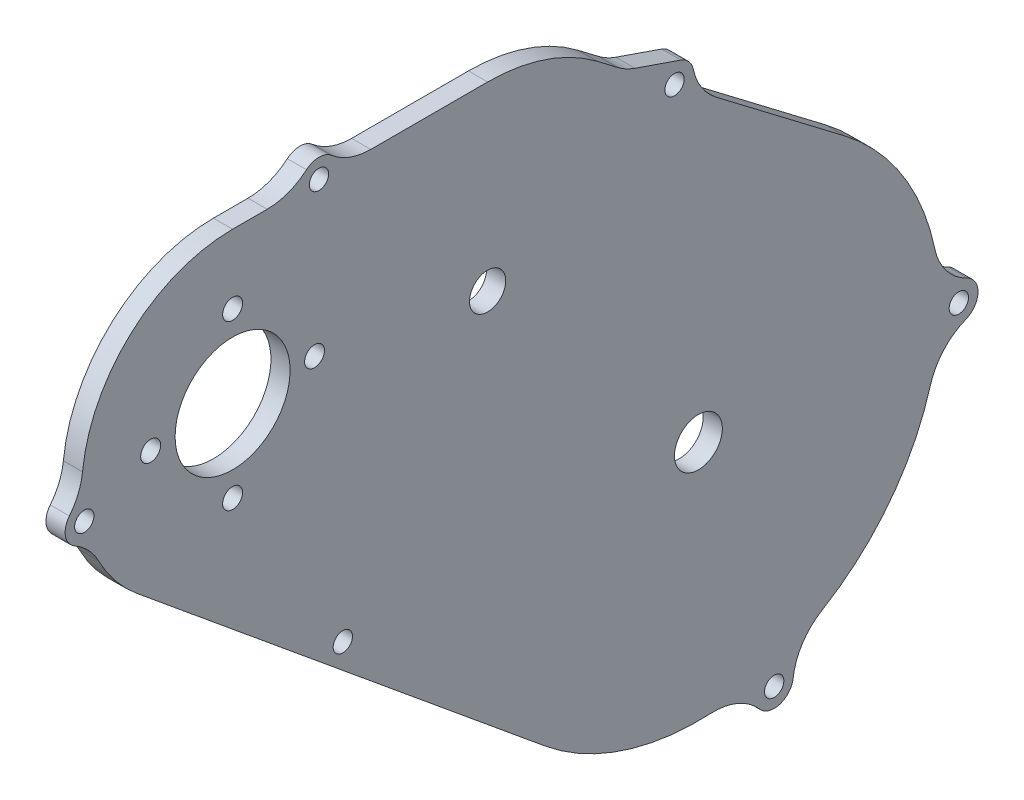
ISO-10303-21;
HEADER;
FILE_DESCRIPTION(('STEP AP214'),'2;1');
FILE_NAME('part.step','',(''),(''),'','','');
FILE_SCHEMA(('AUTOMOTIVE_DESIGN { 1 0 10303 214 1 1 1 1 }'));
ENDSEC;
DATA;
#1=APPLICATION_CONTEXT('core data for automotive mechanical design processes');
#2=APPLICATION_PROTOCOL_DEFINITION('international standard','automotive_design',2000,#1);
#3=PRODUCT_CONTEXT('',#1,'mechanical');
#4=PRODUCT('Part','Part','',(#3));
#5=PRODUCT_RELATED_PRODUCT_CATEGORY('part','',(#4));
#6=PRODUCT_DEFINITION_FORMATION('','',#4);
#7=PRODUCT_DEFINITION_CONTEXT('part definition',#1,'design');
#8=PRODUCT_DEFINITION('design','',#6,#7);
#9=PRODUCT_DEFINITION_SHAPE('','',#8);
#10=(LENGTH_UNIT() NAMED_UNIT(*) SI_UNIT(.MILLI.,.METRE.));
#11=(NAMED_UNIT(*) PLANE_ANGLE_UNIT() SI_UNIT($,.RADIAN.));
#12=(NAMED_UNIT(*) SI_UNIT($,.STERADIAN.) SOLID_ANGLE_UNIT());
#13=UNCERTAINTY_MEASURE_WITH_UNIT(LENGTH_MEASURE(1.E-05),#10,'distance_accuracy_value','');
#14=(GEOMETRIC_REPRESENTATION_CONTEXT(3) GLOBAL_UNCERTAINTY_ASSIGNED_CONTEXT((#13)) GLOBAL_UNIT_ASSIGNED_CONTEXT((#10,
#11,#12)) REPRESENTATION_CONTEXT('',''));
#15=CARTESIAN_POINT('',(0.,0.,0.));
#16=DIRECTION('',(0.,0.,1.));
#17=DIRECTION('',(1.,0.,0.));
#18=AXIS2_PLACEMENT_3D('',#15,#16,#17);
#19=CARTESIAN_POINT('',(6.35,244.8,-60.2996562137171));
#20=DIRECTION('',(-1.,0.,0.));
#21=DIRECTION('',(0.,0.,1.));
#22=AXIS2_PLACEMENT_3D('',#19,#20,#21);
#23=CYLINDRICAL_SURFACE('',#22,50.);
#24=CARTESIAN_POINT('',(0.,244.8,-60.2996562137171));
#25=DIRECTION('',(1.,0.,0.));
#26=DIRECTION('',(0.,0.,-1.));
#27=AXIS2_PLACEMENT_3D('',#24,#25,#26);
#28=CIRCLE('',#27,50.);
#29=CARTESIAN_POINT('',(0.,294.8,-60.2996562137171));
#30=VERTEX_POINT('',#29);
#31=CARTESIAN_POINT('',(0.,250.046117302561,-10.5756353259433));
#32=VERTEX_POINT('',#31);
#33=EDGE_CURVE('E273',#30,#32,#28,.T.);
#34=ORIENTED_EDGE('',*,*,#33,.T.);
#35=DIRECTION('',(-1.,0.,0.));
#36=VECTOR('',#35,1.);
#37=CARTESIAN_POINT('',(6.35,250.046117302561,-10.5756353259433));
#38=LINE('',#37,#36);
#39=CARTESIAN_POINT('',(6.35,250.046117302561,-10.5756353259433));
#40=VERTEX_POINT('',#39);
#41=EDGE_CURVE('E354',#32,#40,#38,.F.);
#42=ORIENTED_EDGE('',*,*,#41,.T.);
#43=CARTESIAN_POINT('',(6.35,244.8,-60.2996562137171));
#44=DIRECTION('',(1.,0.,0.));
#45=DIRECTION('',(0.,0.,-1.));
#46=AXIS2_PLACEMENT_3D('',#43,#44,#45);
#47=CIRCLE('',#46,50.);
#48=CARTESIAN_POINT('',(6.35,294.8,-60.2996562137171));
#49=VERTEX_POINT('',#48);
#50=EDGE_CURVE('E296',#49,#40,#47,.T.);
#51=ORIENTED_EDGE('',*,*,#50,.F.);
#52=DIRECTION('',(-1.,0.,0.));
#53=VECTOR('',#52,1.);
#54=CARTESIAN_POINT('',(6.35,294.8,-60.2996562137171));
#55=LINE('',#54,#53);
#56=EDGE_CURVE('E327',#49,#30,#55,.T.);
#57=ORIENTED_EDGE('',*,*,#56,.T.);
#58=EDGE_LOOP('',(#34,#42,#51,#57));
#59=FACE_BOUND('',#58,.T.);
#60=ADVANCED_FACE('F34',(#59),#23,.T.);
#61=CARTESIAN_POINT('',(6.35,294.8,1.93664151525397E-13));
#62=DIRECTION('',(0.,1.,0.));
#63=DIRECTION('',(0.,0.,1.));
#64=AXIS2_PLACEMENT_3D('',#61,#62,#63);
#65=PLANE('',#64);
#66=DIRECTION('',(0.,0.,-1.));
#67=VECTOR('',#66,1.);
#68=CARTESIAN_POINT('',(0.,294.8,1.93664151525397E-13));
#69=LINE('',#68,#67);
#70=CARTESIAN_POINT('',(0.,294.8,-106.074630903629));
#71=VERTEX_POINT('',#70);
#72=CARTESIAN_POINT('',(0.,294.8,-144.8));
#73=VERTEX_POINT('',#72);
#74=EDGE_CURVE('E318',#71,#73,#69,.T.);
#75=ORIENTED_EDGE('',*,*,#74,.F.);
#76=DIRECTION('',(1.,0.,0.));
#77=VECTOR('',#76,1.);
#78=CARTESIAN_POINT('',(6.35,294.8,-106.074630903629));
#79=LINE('',#78,#77);
#80=CARTESIAN_POINT('',(6.35,294.8,-106.074630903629));
#81=VERTEX_POINT('',#80);
#82=EDGE_CURVE('E344',#71,#81,#79,.T.);
#83=ORIENTED_EDGE('',*,*,#82,.T.);
#84=DIRECTION('',(0.,0.,-1.));
#85=VECTOR('',#84,1.);
#86=CARTESIAN_POINT('',(6.35,294.8,1.93664151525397E-13));
#87=LINE('',#86,#85);
#88=CARTESIAN_POINT('',(6.35,294.8,-144.8));
#89=VERTEX_POINT('',#88);
#90=EDGE_CURVE('E291',#81,#89,#87,.T.);
#91=ORIENTED_EDGE('',*,*,#90,.T.);
#92=DIRECTION('',(-1.,0.,0.));
#93=VECTOR('',#92,1.);
#94=CARTESIAN_POINT('',(6.35,294.8,-144.8));
#95=LINE('',#94,#93);
#96=EDGE_CURVE('E329',#89,#73,#95,.T.);
#97=ORIENTED_EDGE('',*,*,#96,.T.);
#98=EDGE_LOOP('',(#75,#83,#91,#97));
#99=FACE_BOUND('',#98,.T.);
#100=ADVANCED_FACE('F445',(#99),#65,.T.);
#101=CARTESIAN_POINT('',(6.35,266.222905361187,-202.586681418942));
#102=DIRECTION('',(0.,0.795791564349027,-0.605570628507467));
#103=DIRECTION('',(0.,0.605570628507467,0.795791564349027));
#104=AXIS2_PLACEMENT_3D('',#101,#102,#103);
#105=PLANE('',#104);
#106=DIRECTION('',(0.,-0.605570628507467,-0.795791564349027));
#107=VECTOR('',#106,1.);
#108=CARTESIAN_POINT('',(0.,266.222905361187,-202.586681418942));
#109=LINE('',#108,#107);
#110=CARTESIAN_POINT('',(0.,252.686938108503,-220.374546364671));
#111=VERTEX_POINT('',#110);
#112=CARTESIAN_POINT('',(0.,220.187155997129,-263.083111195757));
#113=VERTEX_POINT('',#112);
#114=EDGE_CURVE('E311',#111,#113,#109,.T.);
#115=ORIENTED_EDGE('',*,*,#114,.F.);
#116=DIRECTION('',(1.,0.,0.));
#117=VECTOR('',#116,1.);
#118=CARTESIAN_POINT('',(6.35,252.686938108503,-220.374546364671));
#119=LINE('',#118,#117);
#120=CARTESIAN_POINT('',(6.35,252.686938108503,-220.374546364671));
#121=VERTEX_POINT('',#120);
#122=EDGE_CURVE('E381',#111,#121,#119,.T.);
#123=ORIENTED_EDGE('',*,*,#122,.T.);
#124=DIRECTION('',(0.,-0.605570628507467,-0.795791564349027));
#125=VECTOR('',#124,1.);
#126=CARTESIAN_POINT('',(6.35,266.222905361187,-202.586681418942));
#127=LINE('',#126,#125);
#128=CARTESIAN_POINT('',(6.35,220.187155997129,-263.083111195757));
#129=VERTEX_POINT('',#128);
#130=EDGE_CURVE('E283',#121,#129,#127,.T.);
#131=ORIENTED_EDGE('',*,*,#130,.T.);
#132=DIRECTION('',(-1.,0.,0.));
#133=VECTOR('',#132,1.);
#134=CARTESIAN_POINT('',(6.35,220.187155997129,-263.083111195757));
#135=LINE('',#134,#133);
#136=EDGE_CURVE('E334',#129,#113,#135,.T.);
#137=ORIENTED_EDGE('',*,*,#136,.T.);
#138=EDGE_LOOP('',(#115,#123,#131,#137));
#139=FACE_BOUND('',#138,.T.);
#140=ADVANCED_FACE('F430',(#139),#105,.T.);
#141=CARTESIAN_POINT('',(6.35,156.523830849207,-214.637460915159));
#142=DIRECTION('',(-1.,0.,0.));
#143=DIRECTION('',(0.,0.,1.));
#144=AXIS2_PLACEMENT_3D('',#141,#142,#143);
#145=CYLINDRICAL_SURFACE('',#144,80.);
#146=CARTESIAN_POINT('',(6.35,156.523830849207,-214.637460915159));
#147=DIRECTION('',(1.,0.,0.));
#148=DIRECTION('',(0.,0.,-1.));
#149=AXIS2_PLACEMENT_3D('',#146,#147,#148);
#150=CIRCLE('',#149,80.);
#151=CARTESIAN_POINT('',(6.35,87.8295366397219,-255.638606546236));
#152=VERTEX_POINT('',#151);
#153=CARTESIAN_POINT('',(6.35,134.421111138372,-291.523544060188));
#154=VERTEX_POINT('',#153);
#155=EDGE_CURVE('E284',#152,#154,#150,.T.);
#156=ORIENTED_EDGE('',*,*,#155,.F.);
#157=DIRECTION('',(-1.,0.,0.));
#158=VECTOR('',#157,1.);
#159=CARTESIAN_POINT('',(6.35,87.8295366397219,-255.638606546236));
#160=LINE('',#159,#158);
#161=CARTESIAN_POINT('',(0.,87.8295366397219,-255.638606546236));
#162=VERTEX_POINT('',#161);
#163=EDGE_CURVE('E368',#152,#162,#160,.T.);
#164=ORIENTED_EDGE('',*,*,#163,.T.);
#165=CARTESIAN_POINT('',(0.,156.523830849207,-214.637460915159));
#166=DIRECTION('',(1.,0.,0.));
#167=DIRECTION('',(0.,0.,-1.));
#168=AXIS2_PLACEMENT_3D('',#165,#166,#167);
#169=CIRCLE('',#168,80.);
#170=CARTESIAN_POINT('',(0.,134.421111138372,-291.523544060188));
#171=VERTEX_POINT('',#170);
#172=EDGE_CURVE('E312',#162,#171,#169,.T.);
#173=ORIENTED_EDGE('',*,*,#172,.T.);
#174=DIRECTION('',(-1.,0.,0.));
#175=VECTOR('',#174,1.);
#176=CARTESIAN_POINT('',(6.35,134.421111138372,-291.523544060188));
#177=LINE('',#176,#175);
#178=EDGE_CURVE('E366',#171,#154,#177,.F.);
#179=ORIENTED_EDGE('',*,*,#178,.T.);
#180=EDGE_LOOP('',(#156,#164,#173,#179));
#181=FACE_BOUND('',#180,.T.);
#182=ADVANCED_FACE('F618',(#181),#145,.T.);
#183=CARTESIAN_POINT('',(6.35,172.916566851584,-292.939939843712));
#184=VERTEX_POINT('',#183);
#185=EDGE_CURVE('E279',#184,#129,#150,.T.);
#186=ORIENTED_EDGE('',*,*,#185,.F.);
#187=DIRECTION('',(-1.,0.,0.));
#188=VECTOR('',#187,1.);
#189=CARTESIAN_POINT('',(6.35,172.916566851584,-292.939939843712));
#190=LINE('',#189,#188);
#191=CARTESIAN_POINT('',(0.,172.916566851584,-292.939939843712));
#192=VERTEX_POINT('',#191);
#193=EDGE_CURVE('E371',#184,#192,#190,.T.);
#194=ORIENTED_EDGE('',*,*,#193,.T.);
#195=EDGE_CURVE('E307',#192,#113,#169,.T.);
#196=ORIENTED_EDGE('',*,*,#195,.T.);
#197=ORIENTED_EDGE('',*,*,#136,.F.);
#198=EDGE_LOOP('',(#186,#194,#196,#197));
#199=FACE_BOUND('',#198,.T.);
#200=ADVANCED_FACE('F619',(#199),#145,.T.);
#201=CARTESIAN_POINT('',(6.35,136.831335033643,-112.723133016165));
#202=DIRECTION('',(0.,-0.771823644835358,0.635836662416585));
#203=DIRECTION('',(0.,-0.635836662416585,-0.771823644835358));
#204=AXIS2_PLACEMENT_3D('',#201,#202,#203);
#205=PLANE('',#204);
#206=DIRECTION('',(0.,0.635836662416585,0.771823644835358));
#207=VECTOR('',#206,1.);
#208=CARTESIAN_POINT('',(0.,136.831335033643,-112.723133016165));
#209=LINE('',#208,#207);
#210=CARTESIAN_POINT('',(0.,94.7779392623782,-163.770527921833));
#211=VERTEX_POINT('',#210);
#212=CARTESIAN_POINT('',(0.,206.208817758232,-28.5078230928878));
#213=VERTEX_POINT('',#212);
#214=EDGE_CURVE('E304',#211,#213,#209,.T.);
#215=ORIENTED_EDGE('',*,*,#214,.F.);
#216=DIRECTION('',(-1.,0.,0.));
#217=VECTOR('',#216,1.);
#218=CARTESIAN_POINT('',(6.35,94.7779392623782,-163.770527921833));
#219=LINE('',#218,#217);
#220=CARTESIAN_POINT('',(6.35,94.7779392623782,-163.770527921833));
#221=VERTEX_POINT('',#220);
#222=EDGE_CURVE('E337',#221,#211,#219,.T.);
#223=ORIENTED_EDGE('',*,*,#222,.F.);
#224=DIRECTION('',(0.,0.635836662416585,0.771823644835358));
#225=VECTOR('',#224,1.);
#226=CARTESIAN_POINT('',(6.35,136.831335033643,-112.723133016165));
#227=LINE('',#226,#225);
#228=CARTESIAN_POINT('',(6.35,206.208817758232,-28.5078230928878));
#229=VERTEX_POINT('',#228);
#230=EDGE_CURVE('E276',#221,#229,#227,.T.);
#231=ORIENTED_EDGE('',*,*,#230,.T.);
#232=DIRECTION('',(-1.,0.,0.));
#233=VECTOR('',#232,1.);
#234=CARTESIAN_POINT('',(6.35,206.208817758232,-28.5078230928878));
#235=LINE('',#234,#233);
#236=EDGE_CURVE('E298',#229,#213,#235,.T.);
#237=ORIENTED_EDGE('',*,*,#236,.T.);
#238=EDGE_LOOP('',(#215,#223,#231,#237));
#239=FACE_BOUND('',#238,.T.);
#240=ADVANCED_FACE('F615',(#239),#205,.T.);
#241=CARTESIAN_POINT('',(0.,76.6311943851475,-218.780725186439));
#242=VERTEX_POINT('',#241);
#243=EDGE_CURVE('E308',#211,#242,#169,.T.);
#244=ORIENTED_EDGE('',*,*,#243,.T.);
#245=DIRECTION('',(-1.,0.,0.));
#246=VECTOR('',#245,1.);
#247=CARTESIAN_POINT('',(6.35,76.6311943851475,-218.780725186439));
#248=LINE('',#247,#246);
#249=CARTESIAN_POINT('',(6.35,76.6311943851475,-218.780725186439));
#250=VERTEX_POINT('',#249);
#251=EDGE_CURVE('E364',#242,#250,#248,.F.);
#252=ORIENTED_EDGE('',*,*,#251,.T.);
#253=EDGE_CURVE('E280',#221,#250,#150,.T.);
#254=ORIENTED_EDGE('',*,*,#253,.F.);
#255=ORIENTED_EDGE('',*,*,#222,.T.);
#256=EDGE_LOOP('',(#244,#252,#254,#255));
#257=FACE_BOUND('',#256,.T.);
#258=ADVANCED_FACE('F608',(#257),#145,.T.);
#259=CARTESIAN_POINT('',(6.35,282.547493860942,-181.134237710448));
#260=VERTEX_POINT('',#259);
#261=CARTESIAN_POINT('',(6.35,277.316939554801,-188.007805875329));
#262=VERTEX_POINT('',#261);
#263=EDGE_CURVE('E285',#260,#262,#127,.T.);
#264=ORIENTED_EDGE('',*,*,#263,.T.);
#265=DIRECTION('',(-1.,0.,0.));
#266=VECTOR('',#265,1.);
#267=CARTESIAN_POINT('',(0.,277.316939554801,-188.007805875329));
#268=LINE('',#267,#266);
#269=CARTESIAN_POINT('',(0.,277.316939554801,-188.007805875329));
#270=VERTEX_POINT('',#269);
#271=EDGE_CURVE('E383',#262,#270,#268,.T.);
#272=ORIENTED_EDGE('',*,*,#271,.T.);
#273=CARTESIAN_POINT('',(0.,282.547493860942,-181.134237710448));
#274=VERTEX_POINT('',#273);
#275=EDGE_CURVE('E313',#274,#270,#109,.T.);
#276=ORIENTED_EDGE('',*,*,#275,.F.);
#277=DIRECTION('',(-1.,0.,0.));
#278=VECTOR('',#277,1.);
#279=CARTESIAN_POINT('',(6.35,282.547493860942,-181.134237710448));
#280=LINE('',#279,#278);
#281=EDGE_CURVE('E332',#260,#274,#280,.T.);
#282=ORIENTED_EDGE('',*,*,#281,.F.);
#283=EDGE_LOOP('',(#264,#272,#276,#282));
#284=FACE_BOUND('',#283,.T.);
#285=ADVANCED_FACE('F604',(#284),#105,.T.);
#286=CARTESIAN_POINT('',(6.35,234.8,-144.8));
#287=DIRECTION('',(-1.,0.,0.));
#288=DIRECTION('',(0.,0.,1.));
#289=AXIS2_PLACEMENT_3D('',#286,#287,#288);
#290=CYLINDRICAL_SURFACE('',#289,60.);
#291=CARTESIAN_POINT('',(0.,234.8,-144.8));
#292=DIRECTION('',(1.,0.,0.));
#293=DIRECTION('',(0.,0.,-1.));
#294=AXIS2_PLACEMENT_3D('',#291,#292,#293);
#295=CIRCLE('',#294,60.);
#296=EDGE_CURVE('E315',#274,#73,#295,.T.);
#297=ORIENTED_EDGE('',*,*,#296,.T.);
#298=ORIENTED_EDGE('',*,*,#96,.F.);
#299=CARTESIAN_POINT('',(6.35,234.8,-144.8));
#300=DIRECTION('',(1.,0.,0.));
#301=DIRECTION('',(0.,0.,-1.));
#302=AXIS2_PLACEMENT_3D('',#299,#300,#301);
#303=CIRCLE('',#302,60.);
#304=EDGE_CURVE('E288',#260,#89,#303,.T.);
#305=ORIENTED_EDGE('',*,*,#304,.F.);
#306=ORIENTED_EDGE('',*,*,#281,.T.);
#307=EDGE_LOOP('',(#297,#298,#305,#306));
#308=FACE_BOUND('',#307,.T.);
#309=ADVANCED_FACE('F601',(#308),#290,.T.);
#310=CARTESIAN_POINT('',(6.35,294.8,-71.76297107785));
#311=VERTEX_POINT('',#310);
#312=EDGE_CURVE('E292',#49,#311,#87,.T.);
#313=ORIENTED_EDGE('',*,*,#312,.T.);
#314=DIRECTION('',(1.,0.,0.));
#315=VECTOR('',#314,1.);
#316=CARTESIAN_POINT('',(0.,294.8,-71.76297107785));
#317=LINE('',#316,#315);
#318=CARTESIAN_POINT('',(0.,294.8,-71.76297107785));
#319=VERTEX_POINT('',#318);
#320=EDGE_CURVE('E346',#311,#319,#317,.F.);
#321=ORIENTED_EDGE('',*,*,#320,.T.);
#322=EDGE_CURVE('E319',#30,#319,#69,.T.);
#323=ORIENTED_EDGE('',*,*,#322,.F.);
#324=ORIENTED_EDGE('',*,*,#56,.F.);
#325=EDGE_LOOP('',(#313,#321,#323,#324));
#326=FACE_BOUND('',#325,.T.);
#327=ADVANCED_FACE('F454',(#326),#65,.T.);
#328=CARTESIAN_POINT('',(6.35,156.523830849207,-214.637460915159));
#329=DIRECTION('',(-1.,0.,0.));
#330=DIRECTION('',(0.,0.,1.));
#331=AXIS2_PLACEMENT_3D('',#328,#329,#330);
#332=CYLINDRICAL_SURFACE('',#331,7.93749999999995);
#333=CARTESIAN_POINT('',(6.35,156.523830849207,-214.637460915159));
#334=DIRECTION('',(1.,0.,0.));
#335=DIRECTION('',(0.,0.,-1.));
#336=AXIS2_PLACEMENT_3D('',#333,#334,#335);
#337=CIRCLE('',#336,7.93749999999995);
#338=CARTESIAN_POINT('',(6.35,156.523830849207,-222.574960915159));
#339=VERTEX_POINT('',#338);
#340=EDGE_CURVE('E272',#339,#339,#337,.T.);
#341=ORIENTED_EDGE('',*,*,#340,.T.);
#342=EDGE_LOOP('',(#341));
#343=FACE_BOUND('',#342,.T.);
#344=CARTESIAN_POINT('',(0.,156.523830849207,-214.637460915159));
#345=DIRECTION('',(1.,0.,0.));
#346=DIRECTION('',(0.,0.,-1.));
#347=AXIS2_PLACEMENT_3D('',#344,#345,#346);
#348=CIRCLE('',#347,7.93749999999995);
#349=CARTESIAN_POINT('',(0.,156.523830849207,-222.574960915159));
#350=VERTEX_POINT('',#349);
#351=EDGE_CURVE('E301',#350,#350,#348,.T.);
#352=ORIENTED_EDGE('',*,*,#351,.F.);
#353=EDGE_LOOP('',(#352));
#354=FACE_BOUND('',#353,.T.);
#355=ADVANCED_FACE('F466',(#343,#354),#332,.F.);
#356=CARTESIAN_POINT('',(6.35,234.8,-144.8));
#357=DIRECTION('',(-1.,0.,0.));
#358=DIRECTION('',(0.,0.,1.));
#359=AXIS2_PLACEMENT_3D('',#356,#357,#358);
#360=CYLINDRICAL_SURFACE('',#359,6.00000000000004);
#361=CARTESIAN_POINT('',(6.35,234.8,-144.8));
#362=DIRECTION('',(1.,0.,0.));
#363=DIRECTION('',(0.,0.,-1.));
#364=AXIS2_PLACEMENT_3D('',#361,#362,#363);
#365=CIRCLE('',#364,6.00000000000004);
#366=CARTESIAN_POINT('',(6.35,234.8,-150.8));
#367=VERTEX_POINT('',#366);
#368=EDGE_CURVE('E269',#367,#367,#365,.T.);
#369=ORIENTED_EDGE('',*,*,#368,.T.);
#370=EDGE_LOOP('',(#369));
#371=FACE_BOUND('',#370,.T.);
#372=CARTESIAN_POINT('',(0.,234.8,-144.8));
#373=DIRECTION('',(1.,0.,0.));
#374=DIRECTION('',(0.,0.,-1.));
#375=AXIS2_PLACEMENT_3D('',#372,#373,#374);
#376=CIRCLE('',#375,6.00000000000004);
#377=CARTESIAN_POINT('',(0.,234.8,-150.8));
#378=VERTEX_POINT('',#377);
#379=EDGE_CURVE('E264',#378,#378,#376,.T.);
#380=ORIENTED_EDGE('',*,*,#379,.F.);
#381=EDGE_LOOP('',(#380));
#382=FACE_BOUND('',#381,.T.);
#383=ADVANCED_FACE('F457',(#371,#382),#360,.F.);
#384=CARTESIAN_POINT('',(6.35,221.848250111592,-15.8787469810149));
#385=VERTEX_POINT('',#384);
#386=EDGE_CURVE('E295',#385,#229,#47,.T.);
#387=ORIENTED_EDGE('',*,*,#386,.F.);
#388=DIRECTION('',(-1.,0.,0.));
#389=VECTOR('',#388,1.);
#390=CARTESIAN_POINT('',(6.35,221.848250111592,-15.8787469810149));
#391=LINE('',#390,#389);
#392=CARTESIAN_POINT('',(0.,221.848250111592,-15.8787469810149));
#393=VERTEX_POINT('',#392);
#394=EDGE_CURVE('E356',#385,#393,#391,.T.);
#395=ORIENTED_EDGE('',*,*,#394,.T.);
#396=EDGE_CURVE('E322',#393,#213,#28,.T.);
#397=ORIENTED_EDGE('',*,*,#396,.T.);
#398=ORIENTED_EDGE('',*,*,#236,.F.);
#399=EDGE_LOOP('',(#387,#395,#397,#398));
#400=FACE_BOUND('',#399,.T.);
#401=ADVANCED_FACE('F448',(#400),#23,.T.);
#402=CARTESIAN_POINT('',(6.35,0.,0.));
#403=DIRECTION('',(1.,0.,0.));
#404=DIRECTION('',(0.,0.,-1.));
#405=AXIS2_PLACEMENT_3D('',#402,#403,#404);
#406=PLANE('',#405);
#407=CARTESIAN_POINT('',(6.35,271.95,-60.2996562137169));
#408=DIRECTION('',(-1.,0.,0.));
#409=DIRECTION('',(0.,0.,1.));
#410=AXIS2_PLACEMENT_3D('',#407,#408,#409);
#411=CIRCLE('',#410,3.30199999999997);
#412=CARTESIAN_POINT('',(6.35,271.95,-56.997656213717));
#413=VERTEX_POINT('',#412);
#414=EDGE_CURVE('E995',#413,#413,#411,.T.);
#415=ORIENTED_EDGE('',*,*,#414,.T.);
#416=EDGE_LOOP('',(#415));
#417=FACE_BOUND('',#416,.T.);
#418=CARTESIAN_POINT('',(6.35,244.8,-87.4496562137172));
#419=DIRECTION('',(-1.,0.,0.));
#420=DIRECTION('',(0.,0.,1.));
#421=AXIS2_PLACEMENT_3D('',#418,#419,#420);
#422=CIRCLE('',#421,3.30200000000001);
#423=CARTESIAN_POINT('',(6.35,244.8,-84.1476562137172));
#424=VERTEX_POINT('',#423);
#425=EDGE_CURVE('E999',#424,#424,#422,.T.);
#426=ORIENTED_EDGE('',*,*,#425,.T.);
#427=EDGE_LOOP('',(#426));
#428=FACE_BOUND('',#427,.T.);
#429=CARTESIAN_POINT('',(6.35,217.65,-60.2996562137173));
#430=DIRECTION('',(-1.,0.,0.));
#431=DIRECTION('',(0.,0.,1.));
#432=AXIS2_PLACEMENT_3D('',#429,#430,#431);
#433=CIRCLE('',#432,3.30200000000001);
#434=CARTESIAN_POINT('',(6.35,217.65,-56.9976562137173));
#435=VERTEX_POINT('',#434);
#436=EDGE_CURVE('E1003',#435,#435,#433,.T.);
#437=ORIENTED_EDGE('',*,*,#436,.T.);
#438=EDGE_LOOP('',(#437));
#439=FACE_BOUND('',#438,.T.);
#440=CARTESIAN_POINT('',(6.35,244.8,-33.1496562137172));
#441=DIRECTION('',(-1.,0.,0.));
#442=DIRECTION('',(0.,0.,1.));
#443=AXIS2_PLACEMENT_3D('',#440,#441,#442);
#444=CIRCLE('',#443,3.30199999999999);
#445=CARTESIAN_POINT('',(6.35,244.8,-29.8476562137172));
#446=VERTEX_POINT('',#445);
#447=EDGE_CURVE('E1007',#446,#446,#444,.T.);
#448=ORIENTED_EDGE('',*,*,#447,.T.);
#449=EDGE_LOOP('',(#448));
#450=FACE_BOUND('',#449,.T.);
#451=CARTESIAN_POINT('',(6.35,244.8,-60.2996562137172));
#452=DIRECTION('',(-1.,0.,0.));
#453=DIRECTION('',(0.,0.,1.));
#454=AXIS2_PLACEMENT_3D('',#451,#452,#453);
#455=CIRCLE('',#454,19.05);
#456=CARTESIAN_POINT('',(6.35,244.8,-41.2496562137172));
#457=VERTEX_POINT('',#456);
#458=EDGE_CURVE('E565',#457,#457,#455,.T.);
#459=ORIENTED_EDGE('',*,*,#458,.T.);
#460=EDGE_LOOP('',(#459));
#461=FACE_BOUND('',#460,.T.);
#462=CARTESIAN_POINT('',(6.35,263.076004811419,-206.722081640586));
#463=DIRECTION('',(-1.,0.,0.));
#464=DIRECTION('',(0.,0.,1.));
#465=AXIS2_PLACEMENT_3D('',#462,#463,#464);
#466=CIRCLE('',#465,3.2);
#467=CARTESIAN_POINT('',(6.35,263.076004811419,-203.522081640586));
#468=VERTEX_POINT('',#467);
#469=EDGE_CURVE('E218',#468,#468,#466,.T.);
#470=ORIENTED_EDGE('',*,*,#469,.T.);
#471=EDGE_LOOP('',(#470));
#472=FACE_BOUND('',#471,.T.);
#473=CARTESIAN_POINT('',(6.35,294.8,-88.9188009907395));
#474=DIRECTION('',(-1.,0.,0.));
#475=DIRECTION('',(0.,0.,1.));
#476=AXIS2_PLACEMENT_3D('',#473,#474,#475);
#477=CIRCLE('',#476,3.2);
#478=CARTESIAN_POINT('',(6.35,294.8,-85.7188009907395));
#479=VERTEX_POINT('',#478);
#480=EDGE_CURVE('E496',#479,#479,#477,.T.);
#481=ORIENTED_EDGE('',*,*,#480,.T.);
#482=EDGE_LOOP('',(#481));
#483=FACE_BOUND('',#482,.T.);
#484=CARTESIAN_POINT('',(6.35,235.558619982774,-11.1611082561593));
#485=DIRECTION('',(-1.,0.,0.));
#486=DIRECTION('',(0.,0.,1.));
#487=AXIS2_PLACEMENT_3D('',#484,#485,#486);
#488=CIRCLE('',#487,3.20000000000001);
#489=CARTESIAN_POINT('',(6.35,235.558619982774,-7.9611082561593));
#490=VERTEX_POINT('',#489);
#491=EDGE_CURVE('E485',#490,#490,#488,.T.);
#492=ORIENTED_EDGE('',*,*,#491,.T.);
#493=EDGE_LOOP('',(#492));
#494=FACE_BOUND('',#493,.T.);
#495=CARTESIAN_POINT('',(6.35,158.155733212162,-96.8249073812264));
#496=DIRECTION('',(-1.,0.,0.));
#497=DIRECTION('',(0.,0.,1.));
#498=AXIS2_PLACEMENT_3D('',#495,#496,#497);
#499=CIRCLE('',#498,3.20000000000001);
#500=CARTESIAN_POINT('',(6.35,158.155733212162,-93.6249073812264));
#501=VERTEX_POINT('',#500);
#502=EDGE_CURVE('E492',#501,#501,#499,.T.);
#503=ORIENTED_EDGE('',*,*,#502,.T.);
#504=EDGE_LOOP('',(#503));
#505=FACE_BOUND('',#504,.T.);
#506=ORIENTED_EDGE('',*,*,#50,.T.);
#507=CARTESIAN_POINT('',(6.35,252.144564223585,9.31397302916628));
#508=DIRECTION('',(1.,0.,0.));
#509=DIRECTION('',(0.,0.,-1.));
#510=AXIS2_PLACEMENT_3D('',#507,#508,#509);
#511=CIRCLE('',#510,20.);
#512=CARTESIAN_POINT('',(6.35,239.555612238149,-6.22688563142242));
#513=VERTEX_POINT('',#512);
#514=EDGE_CURVE('E397',#40,#513,#511,.F.);
#515=ORIENTED_EDGE('',*,*,#514,.T.);
#516=CARTESIAN_POINT('',(6.35,235.558619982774,-11.1611082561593));
#517=DIRECTION('',(-1.,0.,0.));
#518=DIRECTION('',(0.,0.,1.));
#519=AXIS2_PLACEMENT_3D('',#516,#517,#518);
#520=CIRCLE('',#519,6.34999999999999);
#521=CARTESIAN_POINT('',(6.35,230.042176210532,-8.01605688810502));
#522=VERTEX_POINT('',#521);
#523=EDGE_CURVE('E489',#522,#513,#520,.T.);
#524=ORIENTED_EDGE('',*,*,#523,.F.);
#525=CARTESIAN_POINT('',(6.35,212.667550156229,1.88961671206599));
#526=DIRECTION('',(1.,0.,0.));
#527=DIRECTION('',(0.,0.,-1.));
#528=AXIS2_PLACEMENT_3D('',#525,#526,#527);
#529=CIRCLE('',#528,20.);
#530=EDGE_CURVE('E401',#522,#385,#529,.F.);
#531=ORIENTED_EDGE('',*,*,#530,.T.);
#532=ORIENTED_EDGE('',*,*,#386,.T.);
#533=ORIENTED_EDGE('',*,*,#230,.F.);
#534=ORIENTED_EDGE('',*,*,#253,.T.);
#535=CARTESIAN_POINT('',(6.35,56.6580352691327,-219.816541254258));
#536=DIRECTION('',(1.,0.,0.));
#537=DIRECTION('',(0.,0.,-1.));
#538=AXIS2_PLACEMENT_3D('',#535,#536,#537);
#539=CIRCLE('',#538,20.);
#540=CARTESIAN_POINT('',(6.35,69.7472049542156,-234.938500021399));
#541=VERTEX_POINT('',#540);
#542=EDGE_CURVE('E405',#250,#541,#539,.F.);
#543=ORIENTED_EDGE('',*,*,#542,.T.);
#544=CARTESIAN_POINT('',(6.35,73.9030163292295,-239.739721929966));
#545=DIRECTION('',(-1.,0.,0.));
#546=DIRECTION('',(0.,0.,1.));
#547=AXIS2_PLACEMENT_3D('',#544,#545,#546);
#548=CIRCLE('',#547,6.35);
#549=CARTESIAN_POINT('',(6.35,73.1205196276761,-246.041324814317));
#550=VERTEX_POINT('',#549);
#551=EDGE_CURVE('E248',#550,#541,#548,.T.);
#552=ORIENTED_EDGE('',*,*,#551,.F.);
#553=CARTESIAN_POINT('',(6.35,70.6559630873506,-265.888892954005));
#554=DIRECTION('',(1.,0.,0.));
#555=DIRECTION('',(0.,0.,-1.));
#556=AXIS2_PLACEMENT_3D('',#553,#554,#555);
#557=CIRCLE('',#556,20.);
#558=EDGE_CURVE('E409',#550,#152,#557,.F.);
#559=ORIENTED_EDGE('',*,*,#558,.T.);
#560=ORIENTED_EDGE('',*,*,#155,.T.);
#561=CARTESIAN_POINT('',(6.35,128.895431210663,-310.745064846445));
#562=DIRECTION('',(1.,0.,0.));
#563=DIRECTION('',(0.,0.,-1.));
#564=AXIS2_PLACEMENT_3D('',#561,#562,#563);
#565=CIRCLE('',#564,20.);
#566=CARTESIAN_POINT('',(6.35,147.455886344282,-303.294594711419));
#567=VERTEX_POINT('',#566);
#568=EDGE_CURVE('E417',#154,#567,#565,.F.);
#569=ORIENTED_EDGE('',*,*,#568,.T.);
#570=CARTESIAN_POINT('',(6.35,153.348830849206,-300.929070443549));
#571=DIRECTION('',(-1.,0.,0.));
#572=DIRECTION('',(0.,0.,1.));
#573=AXIS2_PLACEMENT_3D('',#570,#571,#572);
#574=CIRCLE('',#573,6.35000000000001);
#575=CARTESIAN_POINT('',(6.35,159.052003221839,-303.721260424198));
#576=VERTEX_POINT('',#575);
#577=EDGE_CURVE('E260',#576,#567,#574,.T.);
#578=ORIENTED_EDGE('',*,*,#577,.F.);
#579=CARTESIAN_POINT('',(6.35,177.014750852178,-312.51555957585));
#580=DIRECTION('',(1.,0.,0.));
#581=DIRECTION('',(0.,0.,-1.));
#582=AXIS2_PLACEMENT_3D('',#579,#580,#581);
#583=CIRCLE('',#582,20.);
#584=EDGE_CURVE('E413',#576,#184,#583,.F.);
#585=ORIENTED_EDGE('',*,*,#584,.T.);
#586=ORIENTED_EDGE('',*,*,#185,.T.);
#587=ORIENTED_EDGE('',*,*,#130,.F.);
#588=CARTESIAN_POINT('',(6.35,268.602769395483,-232.48595893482));
#589=DIRECTION('',(1.,0.,0.));
#590=DIRECTION('',(0.,0.,-1.));
#591=AXIS2_PLACEMENT_3D('',#588,#589,#590);
#592=CIRCLE('',#591,20.);
#593=CARTESIAN_POINT('',(6.35,264.407881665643,-212.930833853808));
#594=VERTEX_POINT('',#593);
#595=EDGE_CURVE('E234',#121,#594,#592,.F.);
#596=ORIENTED_EDGE('',*,*,#595,.T.);
#597=CARTESIAN_POINT('',(6.35,263.076004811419,-206.722081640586));
#598=DIRECTION('',(-1.,0.,0.));
#599=DIRECTION('',(0.,0.,1.));
#600=AXIS2_PLACEMENT_3D('',#597,#598,#599);
#601=CIRCLE('',#600,6.35000000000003);
#602=CARTESIAN_POINT('',(6.35,269.078231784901,-208.794705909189));
#603=VERTEX_POINT('',#602);
#604=EDGE_CURVE('E217',#603,#594,#601,.T.);
#605=ORIENTED_EDGE('',*,*,#604,.F.);
#606=DIRECTION('',(0.,-0.326397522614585,-0.945232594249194));
#607=VECTOR('',#606,1.);
#608=CARTESIAN_POINT('',(6.35,304.829562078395,-105.260455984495));
#609=LINE('',#608,#607);
#610=CARTESIAN_POINT('',(6.35,274.328118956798,-193.591267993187));
#611=VERTEX_POINT('',#610);
#612=EDGE_CURVE('E209',#611,#603,#609,.T.);
#613=ORIENTED_EDGE('',*,*,#612,.F.);
#614=CARTESIAN_POINT('',(6.35,293.232770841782,-200.119218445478));
#615=DIRECTION('',(1.,0.,0.));
#616=DIRECTION('',(0.,0.,-1.));
#617=AXIS2_PLACEMENT_3D('',#614,#615,#616);
#618=CIRCLE('',#617,20.);
#619=EDGE_CURVE('E11',#611,#262,#618,.F.);
#620=ORIENTED_EDGE('',*,*,#619,.T.);
#621=ORIENTED_EDGE('',*,*,#263,.F.);
#622=ORIENTED_EDGE('',*,*,#304,.T.);
#623=ORIENTED_EDGE('',*,*,#90,.F.);
#624=CARTESIAN_POINT('',(6.35,314.8,-106.074630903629));
#625=DIRECTION('',(1.,0.,0.));
#626=DIRECTION('',(0.,0.,-1.));
#627=AXIS2_PLACEMENT_3D('',#624,#625,#626);
#628=CIRCLE('',#627,20.);
#629=CARTESIAN_POINT('',(6.35,299.619734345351,-93.0531281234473));
#630=VERTEX_POINT('',#629);
#631=EDGE_CURVE('E389',#81,#630,#628,.F.);
#632=ORIENTED_EDGE('',*,*,#631,.T.);
#633=CARTESIAN_POINT('',(6.35,294.8,-88.9188009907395));
#634=DIRECTION('',(-1.,0.,0.));
#635=DIRECTION('',(0.,0.,1.));
#636=AXIS2_PLACEMENT_3D('',#633,#634,#635);
#637=CIRCLE('',#636,6.34999999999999);
#638=CARTESIAN_POINT('',(6.35,299.619734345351,-84.7844738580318));
#639=VERTEX_POINT('',#638);
#640=EDGE_CURVE('E242',#639,#630,#637,.T.);
#641=ORIENTED_EDGE('',*,*,#640,.F.);
#642=CARTESIAN_POINT('',(6.35,314.8,-71.7629710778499));
#643=DIRECTION('',(1.,0.,0.));
#644=DIRECTION('',(0.,0.,-1.));
#645=AXIS2_PLACEMENT_3D('',#642,#643,#644);
#646=CIRCLE('',#645,20.);
#647=EDGE_CURVE('E393',#639,#311,#646,.F.);
#648=ORIENTED_EDGE('',*,*,#647,.T.);
#649=ORIENTED_EDGE('',*,*,#312,.F.);
#650=EDGE_LOOP('',(#506,#515,#524,#531,#532,#533,#534,#543,#552,#559,#560,#569,#578,#585,#586,
#587,#596,#605,#613,#620,#621,#622,#623,#632,#641,#648,#649));
#651=FACE_BOUND('',#650,.T.);
#652=ORIENTED_EDGE('',*,*,#368,.F.);
#653=EDGE_LOOP('',(#652));
#654=FACE_BOUND('',#653,.T.);
#655=ORIENTED_EDGE('',*,*,#340,.F.);
#656=EDGE_LOOP('',(#655));
#657=FACE_BOUND('',#656,.T.);
#658=CARTESIAN_POINT('',(6.35,153.348830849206,-300.929070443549));
#659=DIRECTION('',(-1.,0.,0.));
#660=DIRECTION('',(0.,0.,1.));
#661=AXIS2_PLACEMENT_3D('',#658,#659,#660);
#662=CIRCLE('',#661,3.19999999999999);
#663=CARTESIAN_POINT('',(6.35,153.348830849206,-297.729070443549));
#664=VERTEX_POINT('',#663);
#665=EDGE_CURVE('E257',#664,#664,#662,.T.);
#666=ORIENTED_EDGE('',*,*,#665,.T.);
#667=EDGE_LOOP('',(#666));
#668=FACE_BOUND('',#667,.T.);
#669=CARTESIAN_POINT('',(6.35,73.9030163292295,-239.739721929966));
#670=DIRECTION('',(-1.,0.,0.));
#671=DIRECTION('',(0.,0.,1.));
#672=AXIS2_PLACEMENT_3D('',#669,#670,#671);
#673=CIRCLE('',#672,3.20000000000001);
#674=CARTESIAN_POINT('',(6.35,73.9030163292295,-236.539721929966));
#675=VERTEX_POINT('',#674);
#676=EDGE_CURVE('E245',#675,#675,#673,.T.);
#677=ORIENTED_EDGE('',*,*,#676,.T.);
#678=EDGE_LOOP('',(#677));
#679=FACE_BOUND('',#678,.T.);
#680=ADVANCED_FACE('F230',(#417,#428,#439,#450,#461,#472,#483,#494,#505,#651,#654,#657,#668,
#679),#406,.T.);
#681=CARTESIAN_POINT('',(0.,0.,0.));
#682=DIRECTION('',(1.,0.,0.));
#683=DIRECTION('',(0.,0.,-1.));
#684=AXIS2_PLACEMENT_3D('',#681,#682,#683);
#685=PLANE('',#684);
#686=CARTESIAN_POINT('',(0.,271.95,-60.2996562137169));
#687=DIRECTION('',(-1.,0.,0.));
#688=DIRECTION('',(0.,0.,1.));
#689=AXIS2_PLACEMENT_3D('',#686,#687,#688);
#690=CIRCLE('',#689,3.30199999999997);
#691=CARTESIAN_POINT('',(0.,271.95,-56.997656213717));
#692=VERTEX_POINT('',#691);
#693=EDGE_CURVE('E544',#692,#692,#690,.T.);
#694=ORIENTED_EDGE('',*,*,#693,.F.);
#695=EDGE_LOOP('',(#694));
#696=FACE_BOUND('',#695,.T.);
#697=CARTESIAN_POINT('',(0.,244.8,-87.4496562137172));
#698=DIRECTION('',(-1.,0.,0.));
#699=DIRECTION('',(0.,0.,1.));
#700=AXIS2_PLACEMENT_3D('',#697,#698,#699);
#701=CIRCLE('',#700,3.30200000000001);
#702=CARTESIAN_POINT('',(0.,244.8,-84.1476562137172));
#703=VERTEX_POINT('',#702);
#704=EDGE_CURVE('E548',#703,#703,#701,.T.);
#705=ORIENTED_EDGE('',*,*,#704,.F.);
#706=EDGE_LOOP('',(#705));
#707=FACE_BOUND('',#706,.T.);
#708=CARTESIAN_POINT('',(0.,217.65,-60.2996562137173));
#709=DIRECTION('',(-1.,0.,0.));
#710=DIRECTION('',(0.,0.,1.));
#711=AXIS2_PLACEMENT_3D('',#708,#709,#710);
#712=CIRCLE('',#711,3.30200000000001);
#713=CARTESIAN_POINT('',(0.,217.65,-56.9976562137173));
#714=VERTEX_POINT('',#713);
#715=EDGE_CURVE('E552',#714,#714,#712,.T.);
#716=ORIENTED_EDGE('',*,*,#715,.F.);
#717=EDGE_LOOP('',(#716));
#718=FACE_BOUND('',#717,.T.);
#719=CARTESIAN_POINT('',(0.,244.8,-33.1496562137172));
#720=DIRECTION('',(-1.,0.,0.));
#721=DIRECTION('',(0.,0.,1.));
#722=AXIS2_PLACEMENT_3D('',#719,#720,#721);
#723=CIRCLE('',#722,3.30199999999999);
#724=CARTESIAN_POINT('',(0.,244.8,-29.8476562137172));
#725=VERTEX_POINT('',#724);
#726=EDGE_CURVE('E556',#725,#725,#723,.T.);
#727=ORIENTED_EDGE('',*,*,#726,.F.);
#728=EDGE_LOOP('',(#727));
#729=FACE_BOUND('',#728,.T.);
#730=CARTESIAN_POINT('',(0.,244.8,-60.2996562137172));
#731=DIRECTION('',(-1.,0.,0.));
#732=DIRECTION('',(0.,0.,1.));
#733=AXIS2_PLACEMENT_3D('',#730,#731,#732);
#734=CIRCLE('',#733,19.05);
#735=CARTESIAN_POINT('',(0.,244.8,-41.2496562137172));
#736=VERTEX_POINT('',#735);
#737=EDGE_CURVE('E560',#736,#736,#734,.T.);
#738=ORIENTED_EDGE('',*,*,#737,.F.);
#739=EDGE_LOOP('',(#738));
#740=FACE_BOUND('',#739,.T.);
#741=CARTESIAN_POINT('',(0.,158.155733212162,-96.8249073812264));
#742=DIRECTION('',(-1.,0.,0.));
#743=DIRECTION('',(0.,0.,1.));
#744=AXIS2_PLACEMENT_3D('',#741,#742,#743);
#745=CIRCLE('',#744,3.20000000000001);
#746=CARTESIAN_POINT('',(0.,158.155733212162,-93.6249073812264));
#747=VERTEX_POINT('',#746);
#748=EDGE_CURVE('E563',#747,#747,#745,.T.);
#749=ORIENTED_EDGE('',*,*,#748,.F.);
#750=EDGE_LOOP('',(#749));
#751=FACE_BOUND('',#750,.T.);
#752=ORIENTED_EDGE('',*,*,#396,.F.);
#753=CARTESIAN_POINT('',(0.,212.667550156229,1.88961671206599));
#754=DIRECTION('',(1.,0.,0.));
#755=DIRECTION('',(0.,0.,-1.));
#756=AXIS2_PLACEMENT_3D('',#753,#754,#755);
#757=CIRCLE('',#756,20.);
#758=CARTESIAN_POINT('',(0.,230.042176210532,-8.01605688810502));
#759=VERTEX_POINT('',#758);
#760=EDGE_CURVE('E399',#393,#759,#757,.T.);
#761=ORIENTED_EDGE('',*,*,#760,.T.);
#762=CARTESIAN_POINT('',(0.,235.558619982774,-11.1611082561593));
#763=DIRECTION('',(-1.,0.,0.));
#764=DIRECTION('',(0.,0.,1.));
#765=AXIS2_PLACEMENT_3D('',#762,#763,#764);
#766=CIRCLE('',#765,6.34999999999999);
#767=CARTESIAN_POINT('',(0.,239.555612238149,-6.22688563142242));
#768=VERTEX_POINT('',#767);
#769=EDGE_CURVE('E479',#759,#768,#766,.T.);
#770=ORIENTED_EDGE('',*,*,#769,.T.);
#771=CARTESIAN_POINT('',(0.,252.144564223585,9.31397302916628));
#772=DIRECTION('',(1.,0.,0.));
#773=DIRECTION('',(0.,0.,-1.));
#774=AXIS2_PLACEMENT_3D('',#771,#772,#773);
#775=CIRCLE('',#774,20.);
#776=EDGE_CURVE('E395',#768,#32,#775,.T.);
#777=ORIENTED_EDGE('',*,*,#776,.T.);
#778=ORIENTED_EDGE('',*,*,#33,.F.);
#779=ORIENTED_EDGE('',*,*,#322,.T.);
#780=CARTESIAN_POINT('',(0.,314.8,-71.7629710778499));
#781=DIRECTION('',(1.,0.,0.));
#782=DIRECTION('',(0.,0.,-1.));
#783=AXIS2_PLACEMENT_3D('',#780,#781,#782);
#784=CIRCLE('',#783,20.);
#785=CARTESIAN_POINT('',(0.,299.619734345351,-84.7844738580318));
#786=VERTEX_POINT('',#785);
#787=EDGE_CURVE('E391',#319,#786,#784,.T.);
#788=ORIENTED_EDGE('',*,*,#787,.T.);
#789=CARTESIAN_POINT('',(0.,294.8,-88.9188009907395));
#790=DIRECTION('',(-1.,0.,0.));
#791=DIRECTION('',(0.,0.,1.));
#792=AXIS2_PLACEMENT_3D('',#789,#790,#791);
#793=CIRCLE('',#792,6.34999999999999);
#794=CARTESIAN_POINT('',(0.,299.619734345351,-93.0531281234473));
#795=VERTEX_POINT('',#794);
#796=EDGE_CURVE('E499',#786,#795,#793,.T.);
#797=ORIENTED_EDGE('',*,*,#796,.T.);
#798=CARTESIAN_POINT('',(0.,314.8,-106.074630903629));
#799=DIRECTION('',(1.,0.,0.));
#800=DIRECTION('',(0.,0.,-1.));
#801=AXIS2_PLACEMENT_3D('',#798,#799,#800);
#802=CIRCLE('',#801,20.);
#803=EDGE_CURVE('E387',#795,#71,#802,.T.);
#804=ORIENTED_EDGE('',*,*,#803,.T.);
#805=ORIENTED_EDGE('',*,*,#74,.T.);
#806=ORIENTED_EDGE('',*,*,#296,.F.);
#807=ORIENTED_EDGE('',*,*,#275,.T.);
#808=CARTESIAN_POINT('',(0.,293.232770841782,-200.119218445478));
#809=DIRECTION('',(1.,0.,0.));
#810=DIRECTION('',(0.,0.,-1.));
#811=AXIS2_PLACEMENT_3D('',#808,#809,#810);
#812=CIRCLE('',#811,20.);
#813=CARTESIAN_POINT('',(0.,274.328118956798,-193.591267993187));
#814=VERTEX_POINT('',#813);
#815=EDGE_CURVE('E42',#270,#814,#812,.T.);
#816=ORIENTED_EDGE('',*,*,#815,.T.);
#817=DIRECTION('',(0.,-0.326397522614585,-0.945232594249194));
#818=VECTOR('',#817,1.);
#819=CARTESIAN_POINT('',(0.,304.829562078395,-105.260455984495));
#820=LINE('',#819,#818);
#821=CARTESIAN_POINT('',(0.,269.078231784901,-208.794705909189));
#822=VERTEX_POINT('',#821);
#823=EDGE_CURVE('E241',#814,#822,#820,.T.);
#824=ORIENTED_EDGE('',*,*,#823,.T.);
#825=CARTESIAN_POINT('',(0.,263.076004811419,-206.722081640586));
#826=DIRECTION('',(-1.,0.,0.));
#827=DIRECTION('',(0.,0.,1.));
#828=AXIS2_PLACEMENT_3D('',#825,#826,#827);
#829=CIRCLE('',#828,6.35000000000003);
#830=CARTESIAN_POINT('',(0.,264.407881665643,-212.930833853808));
#831=VERTEX_POINT('',#830);
#832=EDGE_CURVE('E226',#822,#831,#829,.T.);
#833=ORIENTED_EDGE('',*,*,#832,.T.);
#834=CARTESIAN_POINT('',(0.,268.602769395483,-232.48595893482));
#835=DIRECTION('',(1.,0.,0.));
#836=DIRECTION('',(0.,0.,-1.));
#837=AXIS2_PLACEMENT_3D('',#834,#835,#836);
#838=CIRCLE('',#837,20.);
#839=EDGE_CURVE('E419',#831,#111,#838,.T.);
#840=ORIENTED_EDGE('',*,*,#839,.T.);
#841=ORIENTED_EDGE('',*,*,#114,.T.);
#842=ORIENTED_EDGE('',*,*,#195,.F.);
#843=CARTESIAN_POINT('',(0.,177.014750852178,-312.51555957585));
#844=DIRECTION('',(1.,0.,0.));
#845=DIRECTION('',(0.,0.,-1.));
#846=AXIS2_PLACEMENT_3D('',#843,#844,#845);
#847=CIRCLE('',#846,20.);
#848=CARTESIAN_POINT('',(0.,159.052003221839,-303.721260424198));
#849=VERTEX_POINT('',#848);
#850=EDGE_CURVE('E411',#192,#849,#847,.T.);
#851=ORIENTED_EDGE('',*,*,#850,.T.);
#852=CARTESIAN_POINT('',(0.,153.348830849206,-300.929070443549));
#853=DIRECTION('',(-1.,0.,0.));
#854=DIRECTION('',(0.,0.,1.));
#855=AXIS2_PLACEMENT_3D('',#852,#853,#854);
#856=CIRCLE('',#855,6.35000000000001);
#857=CARTESIAN_POINT('',(0.,147.455886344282,-303.294594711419));
#858=VERTEX_POINT('',#857);
#859=EDGE_CURVE('E261',#849,#858,#856,.T.);
#860=ORIENTED_EDGE('',*,*,#859,.T.);
#861=CARTESIAN_POINT('',(0.,128.895431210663,-310.745064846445));
#862=DIRECTION('',(1.,0.,0.));
#863=DIRECTION('',(0.,0.,-1.));
#864=AXIS2_PLACEMENT_3D('',#861,#862,#863);
#865=CIRCLE('',#864,20.);
#866=EDGE_CURVE('E415',#858,#171,#865,.T.);
#867=ORIENTED_EDGE('',*,*,#866,.T.);
#868=ORIENTED_EDGE('',*,*,#172,.F.);
#869=CARTESIAN_POINT('',(0.,70.6559630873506,-265.888892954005));
#870=DIRECTION('',(1.,0.,0.));
#871=DIRECTION('',(0.,0.,-1.));
#872=AXIS2_PLACEMENT_3D('',#869,#870,#871);
#873=CIRCLE('',#872,20.);
#874=CARTESIAN_POINT('',(0.,73.1205196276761,-246.041324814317));
#875=VERTEX_POINT('',#874);
#876=EDGE_CURVE('E407',#162,#875,#873,.T.);
#877=ORIENTED_EDGE('',*,*,#876,.T.);
#878=CARTESIAN_POINT('',(0.,73.9030163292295,-239.739721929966));
#879=DIRECTION('',(-1.,0.,0.));
#880=DIRECTION('',(0.,0.,1.));
#881=AXIS2_PLACEMENT_3D('',#878,#879,#880);
#882=CIRCLE('',#881,6.35);
#883=CARTESIAN_POINT('',(0.,69.7472049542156,-234.938500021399));
#884=VERTEX_POINT('',#883);
#885=EDGE_CURVE('E249',#875,#884,#882,.T.);
#886=ORIENTED_EDGE('',*,*,#885,.T.);
#887=CARTESIAN_POINT('',(0.,56.6580352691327,-219.816541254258));
#888=DIRECTION('',(1.,0.,0.));
#889=DIRECTION('',(0.,0.,-1.));
#890=AXIS2_PLACEMENT_3D('',#887,#888,#889);
#891=CIRCLE('',#890,20.);
#892=EDGE_CURVE('E403',#884,#242,#891,.T.);
#893=ORIENTED_EDGE('',*,*,#892,.T.);
#894=ORIENTED_EDGE('',*,*,#243,.F.);
#895=ORIENTED_EDGE('',*,*,#214,.T.);
#896=EDGE_LOOP('',(#752,#761,#770,#777,#778,#779,#788,#797,#804,#805,#806,#807,#816,#824,#833,
#840,#841,#842,#851,#860,#867,#868,#877,#886,#893,#894,#895));
#897=FACE_BOUND('',#896,.T.);
#898=CARTESIAN_POINT('',(0.,235.558619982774,-11.1611082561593));
#899=DIRECTION('',(-1.,0.,0.));
#900=DIRECTION('',(0.,0.,1.));
#901=AXIS2_PLACEMENT_3D('',#898,#899,#900);
#902=CIRCLE('',#901,3.20000000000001);
#903=CARTESIAN_POINT('',(0.,235.558619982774,-7.9611082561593));
#904=VERTEX_POINT('',#903);
#905=EDGE_CURVE('E486',#904,#904,#902,.T.);
#906=ORIENTED_EDGE('',*,*,#905,.F.);
#907=EDGE_LOOP('',(#906));
#908=FACE_BOUND('',#907,.T.);
#909=CARTESIAN_POINT('',(0.,294.8,-88.9188009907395));
#910=DIRECTION('',(-1.,0.,0.));
#911=DIRECTION('',(0.,0.,1.));
#912=AXIS2_PLACEMENT_3D('',#909,#910,#911);
#913=CIRCLE('',#912,3.2);
#914=CARTESIAN_POINT('',(0.,294.8,-85.7188009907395));
#915=VERTEX_POINT('',#914);
#916=EDGE_CURVE('E502',#915,#915,#913,.T.);
#917=ORIENTED_EDGE('',*,*,#916,.F.);
#918=EDGE_LOOP('',(#917));
#919=FACE_BOUND('',#918,.T.);
#920=ORIENTED_EDGE('',*,*,#379,.T.);
#921=EDGE_LOOP('',(#920));
#922=FACE_BOUND('',#921,.T.);
#923=ORIENTED_EDGE('',*,*,#351,.T.);
#924=EDGE_LOOP('',(#923));
#925=FACE_BOUND('',#924,.T.);
#926=CARTESIAN_POINT('',(0.,263.076004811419,-206.722081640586));
#927=DIRECTION('',(-1.,0.,0.));
#928=DIRECTION('',(0.,0.,1.));
#929=AXIS2_PLACEMENT_3D('',#926,#927,#928);
#930=CIRCLE('',#929,3.2);
#931=CARTESIAN_POINT('',(0.,263.076004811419,-203.522081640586));
#932=VERTEX_POINT('',#931);
#933=EDGE_CURVE('E238',#932,#932,#930,.T.);
#934=ORIENTED_EDGE('',*,*,#933,.F.);
#935=EDGE_LOOP('',(#934));
#936=FACE_BOUND('',#935,.T.);
#937=CARTESIAN_POINT('',(0.,153.348830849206,-300.929070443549));
#938=DIRECTION('',(-1.,0.,0.));
#939=DIRECTION('',(0.,0.,1.));
#940=AXIS2_PLACEMENT_3D('',#937,#938,#939);
#941=CIRCLE('',#940,3.19999999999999);
#942=CARTESIAN_POINT('',(0.,153.348830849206,-297.729070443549));
#943=VERTEX_POINT('',#942);
#944=EDGE_CURVE('E252',#943,#943,#941,.T.);
#945=ORIENTED_EDGE('',*,*,#944,.F.);
#946=EDGE_LOOP('',(#945));
#947=FACE_BOUND('',#946,.T.);
#948=CARTESIAN_POINT('',(0.,73.9030163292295,-239.739721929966));
#949=DIRECTION('',(-1.,0.,0.));
#950=DIRECTION('',(0.,0.,1.));
#951=AXIS2_PLACEMENT_3D('',#948,#949,#950);
#952=CIRCLE('',#951,3.20000000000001);
#953=CARTESIAN_POINT('',(0.,73.9030163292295,-236.539721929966));
#954=VERTEX_POINT('',#953);
#955=EDGE_CURVE('E227',#954,#954,#952,.T.);
#956=ORIENTED_EDGE('',*,*,#955,.F.);
#957=EDGE_LOOP('',(#956));
#958=FACE_BOUND('',#957,.T.);
#959=ADVANCED_FACE('F423',(#696,#707,#718,#729,#740,#751,#897,#908,#919,#922,#925,#936,#947,
#958),#685,.F.);
#960=CARTESIAN_POINT('',(6.35,153.348830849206,-300.929070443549));
#961=DIRECTION('',(-1.,0.,0.));
#962=DIRECTION('',(0.,0.,1.));
#963=AXIS2_PLACEMENT_3D('',#960,#961,#962);
#964=CYLINDRICAL_SURFACE('',#963,3.19999999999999);
#965=ORIENTED_EDGE('',*,*,#665,.F.);
#966=EDGE_LOOP('',(#965));
#967=FACE_BOUND('',#966,.T.);
#968=ORIENTED_EDGE('',*,*,#944,.T.);
#969=EDGE_LOOP('',(#968));
#970=FACE_BOUND('',#969,.T.);
#971=ADVANCED_FACE('F532',(#967,#970),#964,.F.);
#972=CARTESIAN_POINT('',(6.35,153.348830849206,-300.929070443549));
#973=DIRECTION('',(-1.,0.,0.));
#974=DIRECTION('',(0.,0.,1.));
#975=AXIS2_PLACEMENT_3D('',#972,#973,#974);
#976=CYLINDRICAL_SURFACE('',#975,6.35000000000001);
#977=ORIENTED_EDGE('',*,*,#859,.F.);
#978=DIRECTION('',(-1.,0.,0.));
#979=VECTOR('',#978,1.);
#980=CARTESIAN_POINT('',(6.35,159.052003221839,-303.721260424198));
#981=LINE('',#980,#979);
#982=EDGE_CURVE('E377',#849,#576,#981,.F.);
#983=ORIENTED_EDGE('',*,*,#982,.T.);
#984=ORIENTED_EDGE('',*,*,#577,.T.);
#985=DIRECTION('',(-1.,0.,0.));
#986=VECTOR('',#985,1.);
#987=CARTESIAN_POINT('',(6.35,147.455886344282,-303.294594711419));
#988=LINE('',#987,#986);
#989=EDGE_CURVE('E374',#567,#858,#988,.T.);
#990=ORIENTED_EDGE('',*,*,#989,.T.);
#991=EDGE_LOOP('',(#977,#983,#984,#990));
#992=FACE_BOUND('',#991,.T.);
#993=ADVANCED_FACE('F528',(#992),#976,.T.);
#994=CARTESIAN_POINT('',(6.35,73.9030163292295,-239.739721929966));
#995=DIRECTION('',(-1.,0.,0.));
#996=DIRECTION('',(0.,0.,1.));
#997=AXIS2_PLACEMENT_3D('',#994,#995,#996);
#998=CYLINDRICAL_SURFACE('',#997,3.20000000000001);
#999=ORIENTED_EDGE('',*,*,#676,.F.);
#1000=EDGE_LOOP('',(#999));
#1001=FACE_BOUND('',#1000,.T.);
#1002=ORIENTED_EDGE('',*,*,#955,.T.);
#1003=EDGE_LOOP('',(#1002));
#1004=FACE_BOUND('',#1003,.T.);
#1005=ADVANCED_FACE('F521',(#1001,#1004),#998,.F.);
#1006=CARTESIAN_POINT('',(6.35,73.9030163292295,-239.739721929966));
#1007=DIRECTION('',(-1.,0.,0.));
#1008=DIRECTION('',(0.,0.,1.));
#1009=AXIS2_PLACEMENT_3D('',#1006,#1007,#1008);
#1010=CYLINDRICAL_SURFACE('',#1009,6.35);
#1011=ORIENTED_EDGE('',*,*,#551,.T.);
#1012=DIRECTION('',(-1.,0.,0.));
#1013=VECTOR('',#1012,1.);
#1014=CARTESIAN_POINT('',(6.35,69.7472049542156,-234.938500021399));
#1015=LINE('',#1014,#1013);
#1016=EDGE_CURVE('E361',#541,#884,#1015,.T.);
#1017=ORIENTED_EDGE('',*,*,#1016,.T.);
#1018=ORIENTED_EDGE('',*,*,#885,.F.);
#1019=DIRECTION('',(-1.,0.,0.));
#1020=VECTOR('',#1019,1.);
#1021=CARTESIAN_POINT('',(6.35,73.1205196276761,-246.041324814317));
#1022=LINE('',#1021,#1020);
#1023=EDGE_CURVE('E359',#875,#550,#1022,.F.);
#1024=ORIENTED_EDGE('',*,*,#1023,.T.);
#1025=EDGE_LOOP('',(#1011,#1017,#1018,#1024));
#1026=FACE_BOUND('',#1025,.T.);
#1027=ADVANCED_FACE('F513',(#1026),#1010,.T.);
#1028=CARTESIAN_POINT('',(6.35,263.076004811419,-206.722081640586));
#1029=DIRECTION('',(-1.,0.,0.));
#1030=DIRECTION('',(0.,0.,1.));
#1031=AXIS2_PLACEMENT_3D('',#1028,#1029,#1030);
#1032=CYLINDRICAL_SURFACE('',#1031,3.2);
#1033=ORIENTED_EDGE('',*,*,#933,.T.);
#1034=EDGE_LOOP('',(#1033));
#1035=FACE_BOUND('',#1034,.T.);
#1036=ORIENTED_EDGE('',*,*,#469,.F.);
#1037=EDGE_LOOP('',(#1036));
#1038=FACE_BOUND('',#1037,.T.);
#1039=ADVANCED_FACE('F511',(#1035,#1038),#1032,.F.);
#1040=CARTESIAN_POINT('',(6.35,263.076004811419,-206.722081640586));
#1041=DIRECTION('',(-1.,0.,0.));
#1042=DIRECTION('',(0.,0.,1.));
#1043=AXIS2_PLACEMENT_3D('',#1040,#1041,#1042);
#1044=CYLINDRICAL_SURFACE('',#1043,6.35000000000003);
#1045=ORIENTED_EDGE('',*,*,#604,.T.);
#1046=DIRECTION('',(-1.,0.,0.));
#1047=VECTOR('',#1046,1.);
#1048=CARTESIAN_POINT('',(6.35,264.407881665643,-212.930833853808));
#1049=LINE('',#1048,#1047);
#1050=EDGE_CURVE('E379',#594,#831,#1049,.T.);
#1051=ORIENTED_EDGE('',*,*,#1050,.T.);
#1052=ORIENTED_EDGE('',*,*,#832,.F.);
#1053=DIRECTION('',(-1.,0.,0.));
#1054=VECTOR('',#1053,1.);
#1055=CARTESIAN_POINT('',(6.35,269.078231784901,-208.794705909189));
#1056=LINE('',#1055,#1054);
#1057=EDGE_CURVE('E212',#603,#822,#1056,.T.);
#1058=ORIENTED_EDGE('',*,*,#1057,.F.);
#1059=EDGE_LOOP('',(#1045,#1051,#1052,#1058));
#1060=FACE_BOUND('',#1059,.T.);
#1061=ADVANCED_FACE('F222',(#1060),#1044,.T.);
#1062=CARTESIAN_POINT('',(6.35,304.829562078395,-105.260455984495));
#1063=DIRECTION('',(0.,0.945232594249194,-0.326397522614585));
#1064=DIRECTION('',(0.,0.326397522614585,0.945232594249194));
#1065=AXIS2_PLACEMENT_3D('',#1062,#1063,#1064);
#1066=PLANE('',#1065);
#1067=ORIENTED_EDGE('',*,*,#823,.F.);
#1068=DIRECTION('',(-1.,0.,0.));
#1069=VECTOR('',#1068,1.);
#1070=CARTESIAN_POINT('',(6.35,274.328118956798,-193.591267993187));
#1071=LINE('',#1070,#1069);
#1072=EDGE_CURVE('E49',#814,#611,#1071,.F.);
#1073=ORIENTED_EDGE('',*,*,#1072,.T.);
#1074=ORIENTED_EDGE('',*,*,#612,.T.);
#1075=ORIENTED_EDGE('',*,*,#1057,.T.);
#1076=EDGE_LOOP('',(#1067,#1073,#1074,#1075));
#1077=FACE_BOUND('',#1076,.T.);
#1078=ADVANCED_FACE('F211',(#1077),#1066,.T.);
#1079=CARTESIAN_POINT('',(6.35,294.8,-88.9188009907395));
#1080=DIRECTION('',(-1.,0.,0.));
#1081=DIRECTION('',(0.,0.,1.));
#1082=AXIS2_PLACEMENT_3D('',#1079,#1080,#1081);
#1083=CYLINDRICAL_SURFACE('',#1082,3.2);
#1084=ORIENTED_EDGE('',*,*,#916,.T.);
#1085=EDGE_LOOP('',(#1084));
#1086=FACE_BOUND('',#1085,.T.);
#1087=ORIENTED_EDGE('',*,*,#480,.F.);
#1088=EDGE_LOOP('',(#1087));
#1089=FACE_BOUND('',#1088,.T.);
#1090=ADVANCED_FACE('F747',(#1086,#1089),#1083,.F.);
#1091=CARTESIAN_POINT('',(6.35,294.8,-88.9188009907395));
#1092=DIRECTION('',(-1.,0.,0.));
#1093=DIRECTION('',(0.,0.,1.));
#1094=AXIS2_PLACEMENT_3D('',#1091,#1092,#1093);
#1095=CYLINDRICAL_SURFACE('',#1094,6.34999999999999);
#1096=ORIENTED_EDGE('',*,*,#640,.T.);
#1097=DIRECTION('',(-1.,0.,0.));
#1098=VECTOR('',#1097,1.);
#1099=CARTESIAN_POINT('',(6.35,299.619734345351,-93.0531281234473));
#1100=LINE('',#1099,#1098);
#1101=EDGE_CURVE('E341',#630,#795,#1100,.T.);
#1102=ORIENTED_EDGE('',*,*,#1101,.T.);
#1103=ORIENTED_EDGE('',*,*,#796,.F.);
#1104=DIRECTION('',(-1.,0.,0.));
#1105=VECTOR('',#1104,1.);
#1106=CARTESIAN_POINT('',(6.35,299.619734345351,-84.7844738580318));
#1107=LINE('',#1106,#1105);
#1108=EDGE_CURVE('E339',#786,#639,#1107,.F.);
#1109=ORIENTED_EDGE('',*,*,#1108,.T.);
#1110=EDGE_LOOP('',(#1096,#1102,#1103,#1109));
#1111=FACE_BOUND('',#1110,.T.);
#1112=ADVANCED_FACE('F586',(#1111),#1095,.T.);
#1113=CARTESIAN_POINT('',(6.35,235.558619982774,-11.1611082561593));
#1114=DIRECTION('',(-1.,0.,0.));
#1115=DIRECTION('',(0.,0.,1.));
#1116=AXIS2_PLACEMENT_3D('',#1113,#1114,#1115);
#1117=CYLINDRICAL_SURFACE('',#1116,3.20000000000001);
#1118=ORIENTED_EDGE('',*,*,#905,.T.);
#1119=EDGE_LOOP('',(#1118));
#1120=FACE_BOUND('',#1119,.T.);
#1121=ORIENTED_EDGE('',*,*,#491,.F.);
#1122=EDGE_LOOP('',(#1121));
#1123=FACE_BOUND('',#1122,.T.);
#1124=ADVANCED_FACE('F757',(#1120,#1123),#1117,.F.);
#1125=CARTESIAN_POINT('',(6.35,235.558619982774,-11.1611082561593));
#1126=DIRECTION('',(-1.,0.,0.));
#1127=DIRECTION('',(0.,0.,1.));
#1128=AXIS2_PLACEMENT_3D('',#1125,#1126,#1127);
#1129=CYLINDRICAL_SURFACE('',#1128,6.34999999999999);
#1130=ORIENTED_EDGE('',*,*,#523,.T.);
#1131=DIRECTION('',(-1.,0.,0.));
#1132=VECTOR('',#1131,1.);
#1133=CARTESIAN_POINT('',(6.35,239.555612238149,-6.22688563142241));
#1134=LINE('',#1133,#1132);
#1135=EDGE_CURVE('E351',#513,#768,#1134,.T.);
#1136=ORIENTED_EDGE('',*,*,#1135,.T.);
#1137=ORIENTED_EDGE('',*,*,#769,.F.);
#1138=DIRECTION('',(-1.,0.,0.));
#1139=VECTOR('',#1138,1.);
#1140=CARTESIAN_POINT('',(6.35,230.042176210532,-8.01605688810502));
#1141=LINE('',#1140,#1139);
#1142=EDGE_CURVE('E349',#759,#522,#1141,.F.);
#1143=ORIENTED_EDGE('',*,*,#1142,.T.);
#1144=EDGE_LOOP('',(#1130,#1136,#1137,#1143));
#1145=FACE_BOUND('',#1144,.T.);
#1146=ADVANCED_FACE('F482',(#1145),#1129,.T.);
#1147=CARTESIAN_POINT('',(6.35,158.155733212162,-96.8249073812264));
#1148=DIRECTION('',(-1.,0.,0.));
#1149=DIRECTION('',(0.,0.,1.));
#1150=AXIS2_PLACEMENT_3D('',#1147,#1148,#1149);
#1151=CYLINDRICAL_SURFACE('',#1150,3.20000000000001);
#1152=ORIENTED_EDGE('',*,*,#502,.F.);
#1153=EDGE_LOOP('',(#1152));
#1154=FACE_BOUND('',#1153,.T.);
#1155=ORIENTED_EDGE('',*,*,#748,.T.);
#1156=EDGE_LOOP('',(#1155));
#1157=FACE_BOUND('',#1156,.T.);
#1158=ADVANCED_FACE('F639',(#1154,#1157),#1151,.F.);
#1159=CARTESIAN_POINT('',(6.35,314.8,-106.074630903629));
#1160=DIRECTION('',(-1.,0.,0.));
#1161=DIRECTION('',(0.,0.,1.));
#1162=AXIS2_PLACEMENT_3D('',#1159,#1160,#1161);
#1163=CYLINDRICAL_SURFACE('',#1162,20.);
#1164=ORIENTED_EDGE('',*,*,#631,.F.);
#1165=ORIENTED_EDGE('',*,*,#82,.F.);
#1166=ORIENTED_EDGE('',*,*,#803,.F.);
#1167=ORIENTED_EDGE('',*,*,#1101,.F.);
#1168=EDGE_LOOP('',(#1164,#1165,#1166,#1167));
#1169=FACE_BOUND('',#1168,.T.);
#1170=ADVANCED_FACE('F594',(#1169),#1163,.F.);
#1171=CARTESIAN_POINT('',(6.35,314.8,-71.7629710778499));
#1172=DIRECTION('',(-1.,0.,0.));
#1173=DIRECTION('',(0.,0.,1.));
#1174=AXIS2_PLACEMENT_3D('',#1171,#1172,#1173);
#1175=CYLINDRICAL_SURFACE('',#1174,20.);
#1176=ORIENTED_EDGE('',*,*,#647,.F.);
#1177=ORIENTED_EDGE('',*,*,#1108,.F.);
#1178=ORIENTED_EDGE('',*,*,#787,.F.);
#1179=ORIENTED_EDGE('',*,*,#320,.F.);
#1180=EDGE_LOOP('',(#1176,#1177,#1178,#1179));
#1181=FACE_BOUND('',#1180,.T.);
#1182=ADVANCED_FACE('F590',(#1181),#1175,.F.);
#1183=CARTESIAN_POINT('',(6.35,252.144564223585,9.31397302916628));
#1184=DIRECTION('',(1.,0.,0.));
#1185=DIRECTION('',(0.,0.,-1.));
#1186=AXIS2_PLACEMENT_3D('',#1183,#1184,#1185);
#1187=CYLINDRICAL_SURFACE('',#1186,20.);
#1188=ORIENTED_EDGE('',*,*,#514,.F.);
#1189=ORIENTED_EDGE('',*,*,#41,.F.);
#1190=ORIENTED_EDGE('',*,*,#776,.F.);
#1191=ORIENTED_EDGE('',*,*,#1135,.F.);
#1192=EDGE_LOOP('',(#1188,#1189,#1190,#1191));
#1193=FACE_BOUND('',#1192,.T.);
#1194=ADVANCED_FACE('F574',(#1193),#1187,.F.);
#1195=CARTESIAN_POINT('',(6.35,212.667550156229,1.88961671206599));
#1196=DIRECTION('',(1.,0.,0.));
#1197=DIRECTION('',(0.,0.,-1.));
#1198=AXIS2_PLACEMENT_3D('',#1195,#1196,#1197);
#1199=CYLINDRICAL_SURFACE('',#1198,20.);
#1200=ORIENTED_EDGE('',*,*,#530,.F.);
#1201=ORIENTED_EDGE('',*,*,#1142,.F.);
#1202=ORIENTED_EDGE('',*,*,#760,.F.);
#1203=ORIENTED_EDGE('',*,*,#394,.F.);
#1204=EDGE_LOOP('',(#1200,#1201,#1202,#1203));
#1205=FACE_BOUND('',#1204,.T.);
#1206=ADVANCED_FACE('F475',(#1205),#1199,.F.);
#1207=CARTESIAN_POINT('',(6.35,56.6580352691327,-219.816541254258));
#1208=DIRECTION('',(1.,0.,0.));
#1209=DIRECTION('',(0.,0.,-1.));
#1210=AXIS2_PLACEMENT_3D('',#1207,#1208,#1209);
#1211=CYLINDRICAL_SURFACE('',#1210,20.);
#1212=ORIENTED_EDGE('',*,*,#542,.F.);
#1213=ORIENTED_EDGE('',*,*,#251,.F.);
#1214=ORIENTED_EDGE('',*,*,#892,.F.);
#1215=ORIENTED_EDGE('',*,*,#1016,.F.);
#1216=EDGE_LOOP('',(#1212,#1213,#1214,#1215));
#1217=FACE_BOUND('',#1216,.T.);
#1218=ADVANCED_FACE('F646',(#1217),#1211,.F.);
#1219=CARTESIAN_POINT('',(6.35,70.6559630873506,-265.888892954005));
#1220=DIRECTION('',(1.,0.,0.));
#1221=DIRECTION('',(0.,0.,-1.));
#1222=AXIS2_PLACEMENT_3D('',#1219,#1220,#1221);
#1223=CYLINDRICAL_SURFACE('',#1222,20.);
#1224=ORIENTED_EDGE('',*,*,#558,.F.);
#1225=ORIENTED_EDGE('',*,*,#1023,.F.);
#1226=ORIENTED_EDGE('',*,*,#876,.F.);
#1227=ORIENTED_EDGE('',*,*,#163,.F.);
#1228=EDGE_LOOP('',(#1224,#1225,#1226,#1227));
#1229=FACE_BOUND('',#1228,.T.);
#1230=ADVANCED_FACE('F649',(#1229),#1223,.F.);
#1231=CARTESIAN_POINT('',(6.35,177.014750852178,-312.51555957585));
#1232=DIRECTION('',(1.,0.,0.));
#1233=DIRECTION('',(0.,0.,-1.));
#1234=AXIS2_PLACEMENT_3D('',#1231,#1232,#1233);
#1235=CYLINDRICAL_SURFACE('',#1234,20.);
#1236=ORIENTED_EDGE('',*,*,#584,.F.);
#1237=ORIENTED_EDGE('',*,*,#982,.F.);
#1238=ORIENTED_EDGE('',*,*,#850,.F.);
#1239=ORIENTED_EDGE('',*,*,#193,.F.);
#1240=EDGE_LOOP('',(#1236,#1237,#1238,#1239));
#1241=FACE_BOUND('',#1240,.T.);
#1242=ADVANCED_FACE('F441',(#1241),#1235,.F.);
#1243=CARTESIAN_POINT('',(6.35,128.895431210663,-310.745064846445));
#1244=DIRECTION('',(1.,0.,0.));
#1245=DIRECTION('',(0.,0.,-1.));
#1246=AXIS2_PLACEMENT_3D('',#1243,#1244,#1245);
#1247=CYLINDRICAL_SURFACE('',#1246,20.);
#1248=ORIENTED_EDGE('',*,*,#568,.F.);
#1249=ORIENTED_EDGE('',*,*,#178,.F.);
#1250=ORIENTED_EDGE('',*,*,#866,.F.);
#1251=ORIENTED_EDGE('',*,*,#989,.F.);
#1252=EDGE_LOOP('',(#1248,#1249,#1250,#1251));
#1253=FACE_BOUND('',#1252,.T.);
#1254=ADVANCED_FACE('F434',(#1253),#1247,.F.);
#1255=CARTESIAN_POINT('',(6.35,268.602769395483,-232.48595893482));
#1256=DIRECTION('',(-1.,0.,0.));
#1257=DIRECTION('',(0.,0.,1.));
#1258=AXIS2_PLACEMENT_3D('',#1255,#1256,#1257);
#1259=CYLINDRICAL_SURFACE('',#1258,20.);
#1260=ORIENTED_EDGE('',*,*,#595,.F.);
#1261=ORIENTED_EDGE('',*,*,#122,.F.);
#1262=ORIENTED_EDGE('',*,*,#839,.F.);
#1263=ORIENTED_EDGE('',*,*,#1050,.F.);
#1264=EDGE_LOOP('',(#1260,#1261,#1262,#1263));
#1265=FACE_BOUND('',#1264,.T.);
#1266=ADVANCED_FACE('F432',(#1265),#1259,.F.);
#1267=CARTESIAN_POINT('',(6.35,293.232770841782,-200.119218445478));
#1268=DIRECTION('',(1.,0.,0.));
#1269=DIRECTION('',(0.,0.,-1.));
#1270=AXIS2_PLACEMENT_3D('',#1267,#1268,#1269);
#1271=CYLINDRICAL_SURFACE('',#1270,20.);
#1272=ORIENTED_EDGE('',*,*,#619,.F.);
#1273=ORIENTED_EDGE('',*,*,#1072,.F.);
#1274=ORIENTED_EDGE('',*,*,#815,.F.);
#1275=ORIENTED_EDGE('',*,*,#271,.F.);
#1276=EDGE_LOOP('',(#1272,#1273,#1274,#1275));
#1277=FACE_BOUND('',#1276,.T.);
#1278=ADVANCED_FACE('F36',(#1277),#1271,.F.);
#1279=CARTESIAN_POINT('',(6.35,244.8,-60.2996562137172));
#1280=DIRECTION('',(-1.,0.,0.));
#1281=DIRECTION('',(0.,0.,1.));
#1282=AXIS2_PLACEMENT_3D('',#1279,#1280,#1281);
#1283=CYLINDRICAL_SURFACE('',#1282,19.05);
#1284=ORIENTED_EDGE('',*,*,#458,.F.);
#1285=EDGE_LOOP('',(#1284));
#1286=FACE_BOUND('',#1285,.T.);
#1287=ORIENTED_EDGE('',*,*,#737,.T.);
#1288=EDGE_LOOP('',(#1287));
#1289=FACE_BOUND('',#1288,.T.);
#1290=ADVANCED_FACE('F439',(#1286,#1289),#1283,.F.);
#1291=CARTESIAN_POINT('',(6.35,244.8,-33.1496562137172));
#1292=DIRECTION('',(-1.,0.,0.));
#1293=DIRECTION('',(0.,0.,1.));
#1294=AXIS2_PLACEMENT_3D('',#1291,#1292,#1293);
#1295=CYLINDRICAL_SURFACE('',#1294,3.30199999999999);
#1296=ORIENTED_EDGE('',*,*,#447,.F.);
#1297=EDGE_LOOP('',(#1296));
#1298=FACE_BOUND('',#1297,.T.);
#1299=ORIENTED_EDGE('',*,*,#726,.T.);
#1300=EDGE_LOOP('',(#1299));
#1301=FACE_BOUND('',#1300,.T.);
#1302=ADVANCED_FACE('F974',(#1298,#1301),#1295,.F.);
#1303=CARTESIAN_POINT('',(6.35,217.65,-60.2996562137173));
#1304=DIRECTION('',(-1.,0.,0.));
#1305=DIRECTION('',(0.,0.,1.));
#1306=AXIS2_PLACEMENT_3D('',#1303,#1304,#1305);
#1307=CYLINDRICAL_SURFACE('',#1306,3.30200000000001);
#1308=ORIENTED_EDGE('',*,*,#436,.F.);
#1309=EDGE_LOOP('',(#1308));
#1310=FACE_BOUND('',#1309,.T.);
#1311=ORIENTED_EDGE('',*,*,#715,.T.);
#1312=EDGE_LOOP('',(#1311));
#1313=FACE_BOUND('',#1312,.T.);
#1314=ADVANCED_FACE('F978',(#1310,#1313),#1307,.F.);
#1315=CARTESIAN_POINT('',(6.35,244.8,-87.4496562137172));
#1316=DIRECTION('',(-1.,0.,0.));
#1317=DIRECTION('',(0.,0.,1.));
#1318=AXIS2_PLACEMENT_3D('',#1315,#1316,#1317);
#1319=CYLINDRICAL_SURFACE('',#1318,3.30200000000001);
#1320=ORIENTED_EDGE('',*,*,#425,.F.);
#1321=EDGE_LOOP('',(#1320));
#1322=FACE_BOUND('',#1321,.T.);
#1323=ORIENTED_EDGE('',*,*,#704,.T.);
#1324=EDGE_LOOP('',(#1323));
#1325=FACE_BOUND('',#1324,.T.);
#1326=ADVANCED_FACE('F982',(#1322,#1325),#1319,.F.);
#1327=CARTESIAN_POINT('',(6.35,271.95,-60.2996562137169));
#1328=DIRECTION('',(-1.,0.,0.));
#1329=DIRECTION('',(0.,0.,1.));
#1330=AXIS2_PLACEMENT_3D('',#1327,#1328,#1329);
#1331=CYLINDRICAL_SURFACE('',#1330,3.30199999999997);
#1332=ORIENTED_EDGE('',*,*,#414,.F.);
#1333=EDGE_LOOP('',(#1332));
#1334=FACE_BOUND('',#1333,.T.);
#1335=ORIENTED_EDGE('',*,*,#693,.T.);
#1336=EDGE_LOOP('',(#1335));
#1337=FACE_BOUND('',#1336,.T.);
#1338=ADVANCED_FACE('F986',(#1334,#1337),#1331,.F.);
#1339=CLOSED_SHELL('',(#60,#100,#140,#182,#200,#240,#258,#285,#309,#327,#355,#383,#401,#680,
#959,#971,#993,#1005,#1027,#1039,#1061,#1078,#1090,#1112,#1124,#1146,#1158,#1170,#1182,#1194,
#1206,#1218,#1230,#1242,#1254,#1266,#1278,#1290,#1302,#1314,#1326,#1338));
#1340=MANIFOLD_SOLID_BREP('B2',#1339);
#1341=ADVANCED_BREP_SHAPE_REPRESENTATION('',(#18,#1340),#14);
#1342=SHAPE_DEFINITION_REPRESENTATION(#9,#1341);
ENDSEC;
END-ISO-10303-21;
